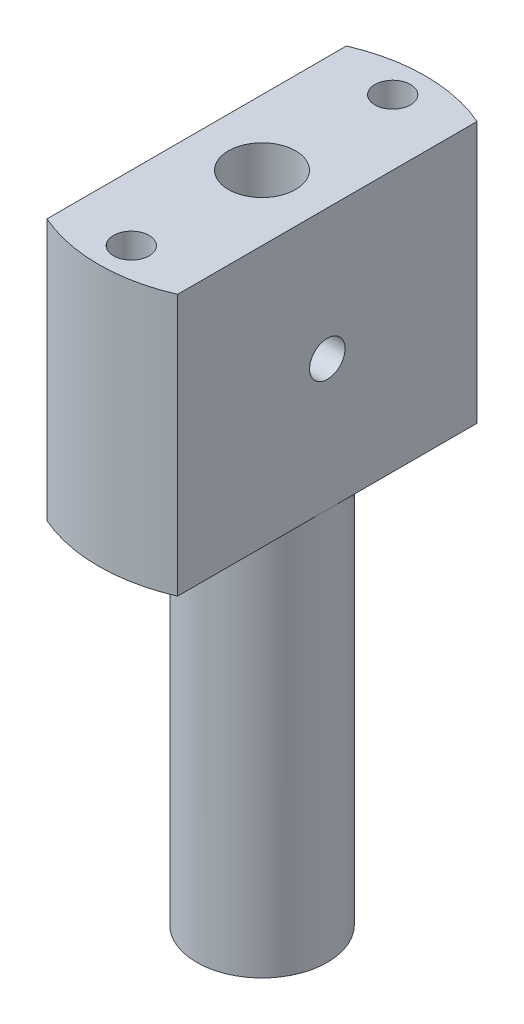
ISO-10303-21;
HEADER;
FILE_DESCRIPTION(('STEP AP214'),'2;1');
FILE_NAME('part.step','',(''),(''),'','','');
FILE_SCHEMA(('AUTOMOTIVE_DESIGN { 1 0 10303 214 1 1 1 1 }'));
ENDSEC;
DATA;
#1=APPLICATION_CONTEXT('core data for automotive mechanical design processes');
#2=APPLICATION_PROTOCOL_DEFINITION('international standard','automotive_design',2000,#1);
#3=PRODUCT_CONTEXT('',#1,'mechanical');
#4=PRODUCT('Part','Part','',(#3));
#5=PRODUCT_RELATED_PRODUCT_CATEGORY('part','',(#4));
#6=PRODUCT_DEFINITION_FORMATION('','',#4);
#7=PRODUCT_DEFINITION_CONTEXT('part definition',#1,'design');
#8=PRODUCT_DEFINITION('design','',#6,#7);
#9=PRODUCT_DEFINITION_SHAPE('','',#8);
#10=(LENGTH_UNIT() NAMED_UNIT(*) SI_UNIT(.MILLI.,.METRE.));
#11=(NAMED_UNIT(*) PLANE_ANGLE_UNIT() SI_UNIT($,.RADIAN.));
#12=(NAMED_UNIT(*) SI_UNIT($,.STERADIAN.) SOLID_ANGLE_UNIT());
#13=UNCERTAINTY_MEASURE_WITH_UNIT(LENGTH_MEASURE(1.E-05),#10,'distance_accuracy_value','');
#14=(GEOMETRIC_REPRESENTATION_CONTEXT(3) GLOBAL_UNCERTAINTY_ASSIGNED_CONTEXT((#13)) GLOBAL_UNIT_ASSIGNED_CONTEXT((#10,
#11,#12)) REPRESENTATION_CONTEXT('',''));
#15=CARTESIAN_POINT('',(0.,0.,0.));
#16=DIRECTION('',(0.,0.,1.));
#17=DIRECTION('',(1.,0.,0.));
#18=AXIS2_PLACEMENT_3D('',#15,#16,#17);
#19=CARTESIAN_POINT('',(-12.7355087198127,63.5,-12.7355087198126));
#20=DIRECTION('',(0.,-1.,0.));
#21=DIRECTION('',(0.,0.,-1.));
#22=AXIS2_PLACEMENT_3D('',#19,#20,#21);
#23=CYLINDRICAL_SURFACE('',#22,15.875);
#24=DIRECTION('',(0.,-1.,0.));
#25=VECTOR('',#24,1.);
#26=CARTESIAN_POINT('',(-19.0855087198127,63.5,-27.2851865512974));
#27=LINE('',#26,#25);
#28=CARTESIAN_POINT('',(-19.0855087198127,63.5,-27.2851865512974));
#29=VERTEX_POINT('',#28);
#30=CARTESIAN_POINT('',(-19.0855087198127,38.1,-27.2851865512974));
#31=VERTEX_POINT('',#30);
#32=EDGE_CURVE('E118',#29,#31,#27,.T.);
#33=ORIENTED_EDGE('',*,*,#32,.F.);
#34=CARTESIAN_POINT('',(-12.7355087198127,63.5,-12.7355087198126));
#35=DIRECTION('',(0.,1.,0.));
#36=DIRECTION('',(0.,0.,1.));
#37=AXIS2_PLACEMENT_3D('',#34,#35,#36);
#38=CIRCLE('',#37,15.875);
#39=CARTESIAN_POINT('',(-6.38550871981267,63.5,-27.2851865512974));
#40=VERTEX_POINT('',#39);
#41=EDGE_CURVE('E110',#40,#29,#38,.T.);
#42=ORIENTED_EDGE('',*,*,#41,.F.);
#43=DIRECTION('',(0.,-1.,0.));
#44=VECTOR('',#43,1.);
#45=CARTESIAN_POINT('',(-6.38550871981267,63.5,-27.2851865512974));
#46=LINE('',#45,#44);
#47=CARTESIAN_POINT('',(-6.38550871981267,38.1,-27.2851865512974));
#48=VERTEX_POINT('',#47);
#49=EDGE_CURVE('E92',#40,#48,#46,.T.);
#50=ORIENTED_EDGE('',*,*,#49,.T.);
#51=CARTESIAN_POINT('',(-12.7355087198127,38.1,-12.7355087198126));
#52=DIRECTION('',(0.,1.,0.));
#53=DIRECTION('',(0.,0.,1.));
#54=AXIS2_PLACEMENT_3D('',#51,#52,#53);
#55=CIRCLE('',#54,15.875);
#56=EDGE_CURVE('E127',#48,#31,#55,.T.);
#57=ORIENTED_EDGE('',*,*,#56,.T.);
#58=EDGE_LOOP('',(#33,#42,#50,#57));
#59=FACE_BOUND('',#58,.T.);
#60=ADVANCED_FACE('F45',(#59),#23,.T.);
#61=DIRECTION('',(0.,-1.,0.));
#62=VECTOR('',#61,1.);
#63=CARTESIAN_POINT('',(-19.0855087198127,63.5,1.81416911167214));
#64=LINE('',#63,#62);
#65=CARTESIAN_POINT('',(-19.0855087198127,38.1,1.81416911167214));
#66=VERTEX_POINT('',#65);
#67=CARTESIAN_POINT('',(-19.0855087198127,63.5,1.81416911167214));
#68=VERTEX_POINT('',#67);
#69=EDGE_CURVE('E103',#66,#68,#64,.F.);
#70=ORIENTED_EDGE('',*,*,#69,.F.);
#71=CARTESIAN_POINT('',(-6.38550871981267,38.1,1.81416911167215));
#72=VERTEX_POINT('',#71);
#73=EDGE_CURVE('E132',#66,#72,#55,.T.);
#74=ORIENTED_EDGE('',*,*,#73,.T.);
#75=DIRECTION('',(0.,-1.,0.));
#76=VECTOR('',#75,1.);
#77=CARTESIAN_POINT('',(-6.38550871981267,63.5,1.81416911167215));
#78=LINE('',#77,#76);
#79=CARTESIAN_POINT('',(-6.38550871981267,63.5,1.81416911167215));
#80=VERTEX_POINT('',#79);
#81=EDGE_CURVE('E61',#72,#80,#78,.F.);
#82=ORIENTED_EDGE('',*,*,#81,.T.);
#83=EDGE_CURVE('E112',#68,#80,#38,.T.);
#84=ORIENTED_EDGE('',*,*,#83,.F.);
#85=EDGE_LOOP('',(#70,#74,#82,#84));
#86=FACE_BOUND('',#85,.T.);
#87=ADVANCED_FACE('F157',(#86),#23,.T.);
#88=CARTESIAN_POINT('',(-12.7355087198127,63.5,-12.7355087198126));
#89=DIRECTION('',(0.,1.,0.));
#90=DIRECTION('',(0.,0.,1.));
#91=AXIS2_PLACEMENT_3D('',#88,#89,#90);
#92=PLANE('',#91);
#93=CARTESIAN_POINT('',(-12.7355087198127,63.5,-25.4355087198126));
#94=DIRECTION('',(0.,1.,0.));
#95=DIRECTION('',(0.,0.,1.));
#96=AXIS2_PLACEMENT_3D('',#93,#94,#95);
#97=CIRCLE('',#96,1.72719999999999);
#98=CARTESIAN_POINT('',(-12.7355087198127,63.5,-23.7083087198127));
#99=VERTEX_POINT('',#98);
#100=EDGE_CURVE('E145',#99,#99,#97,.T.);
#101=ORIENTED_EDGE('',*,*,#100,.F.);
#102=EDGE_LOOP('',(#101));
#103=FACE_BOUND('',#102,.T.);
#104=CARTESIAN_POINT('',(-12.7355087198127,63.5,-0.0355087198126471));
#105=DIRECTION('',(0.,1.,0.));
#106=DIRECTION('',(0.,0.,1.));
#107=AXIS2_PLACEMENT_3D('',#104,#105,#106);
#108=CIRCLE('',#107,1.72719999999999);
#109=CARTESIAN_POINT('',(-12.7355087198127,63.5,1.69169128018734));
#110=VERTEX_POINT('',#109);
#111=EDGE_CURVE('E144',#110,#110,#108,.T.);
#112=ORIENTED_EDGE('',*,*,#111,.F.);
#113=EDGE_LOOP('',(#112));
#114=FACE_BOUND('',#113,.T.);
#115=CARTESIAN_POINT('',(-12.7355087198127,63.5,-12.7355087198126));
#116=DIRECTION('',(0.,1.,0.));
#117=DIRECTION('',(0.,0.,1.));
#118=AXIS2_PLACEMENT_3D('',#115,#116,#117);
#119=CIRCLE('',#118,3.26389999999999);
#120=CARTESIAN_POINT('',(-12.7355087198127,63.5,-9.47160871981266));
#121=VERTEX_POINT('',#120);
#122=EDGE_CURVE('E196',#121,#121,#119,.T.);
#123=ORIENTED_EDGE('',*,*,#122,.F.);
#124=EDGE_LOOP('',(#123));
#125=FACE_BOUND('',#124,.T.);
#126=ORIENTED_EDGE('',*,*,#41,.T.);
#127=DIRECTION('',(0.,0.,1.));
#128=VECTOR('',#127,1.);
#129=CARTESIAN_POINT('',(-19.0855087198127,63.5,-29.282498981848));
#130=LINE('',#129,#128);
#131=EDGE_CURVE('E114',#29,#68,#130,.T.);
#132=ORIENTED_EDGE('',*,*,#131,.T.);
#133=ORIENTED_EDGE('',*,*,#83,.T.);
#134=DIRECTION('',(0.,0.,1.));
#135=VECTOR('',#134,1.);
#136=CARTESIAN_POINT('',(-6.38550871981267,63.5,-29.282498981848));
#137=LINE('',#136,#135);
#138=EDGE_CURVE('E95',#40,#80,#137,.T.);
#139=ORIENTED_EDGE('',*,*,#138,.F.);
#140=EDGE_LOOP('',(#126,#132,#133,#139));
#141=FACE_BOUND('',#140,.T.);
#142=ADVANCED_FACE('F108',(#103,#114,#125,#141),#92,.T.);
#143=CARTESIAN_POINT('',(-12.7355087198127,38.1,-12.7355087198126));
#144=DIRECTION('',(0.,1.,0.));
#145=DIRECTION('',(0.,0.,1.));
#146=AXIS2_PLACEMENT_3D('',#143,#144,#145);
#147=PLANE('',#146);
#148=CARTESIAN_POINT('',(-12.7355087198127,38.1,-25.4355087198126));
#149=DIRECTION('',(0.,1.,0.));
#150=DIRECTION('',(0.,0.,1.));
#151=AXIS2_PLACEMENT_3D('',#148,#149,#150);
#152=CIRCLE('',#151,1.72719999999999);
#153=CARTESIAN_POINT('',(-12.7355087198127,38.1,-23.7083087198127));
#154=VERTEX_POINT('',#153);
#155=EDGE_CURVE('E141',#154,#154,#152,.T.);
#156=ORIENTED_EDGE('',*,*,#155,.T.);
#157=EDGE_LOOP('',(#156));
#158=FACE_BOUND('',#157,.T.);
#159=DIRECTION('',(0.,0.,1.));
#160=VECTOR('',#159,1.);
#161=CARTESIAN_POINT('',(-19.0855087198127,38.1,-12.7355087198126));
#162=LINE('',#161,#160);
#163=CARTESIAN_POINT('',(-19.0855087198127,38.1,-12.7355087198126));
#164=VERTEX_POINT('',#163);
#165=EDGE_CURVE('E11',#31,#164,#162,.T.);
#166=ORIENTED_EDGE('',*,*,#165,.F.);
#167=ORIENTED_EDGE('',*,*,#56,.F.);
#168=DIRECTION('',(0.,0.,1.));
#169=VECTOR('',#168,1.);
#170=CARTESIAN_POINT('',(-6.38550871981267,38.1,-12.7355087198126));
#171=LINE('',#170,#169);
#172=CARTESIAN_POINT('',(-6.38550871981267,38.1,-12.7355087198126));
#173=VERTEX_POINT('',#172);
#174=EDGE_CURVE('E97',#48,#173,#171,.T.);
#175=ORIENTED_EDGE('',*,*,#174,.T.);
#176=CARTESIAN_POINT('',(-12.7355087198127,38.1,-12.7355087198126));
#177=DIRECTION('',(0.,1.,0.));
#178=DIRECTION('',(0.,0.,1.));
#179=AXIS2_PLACEMENT_3D('',#176,#177,#178);
#180=CIRCLE('',#179,6.35);
#181=EDGE_CURVE('E136',#173,#164,#180,.T.);
#182=ORIENTED_EDGE('',*,*,#181,.T.);
#183=EDGE_LOOP('',(#166,#167,#175,#182));
#184=FACE_BOUND('',#183,.T.);
#185=ADVANCED_FACE('F162',(#158,#184),#147,.F.);
#186=CARTESIAN_POINT('',(-12.7355087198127,38.1,-0.0355087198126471));
#187=DIRECTION('',(0.,1.,0.));
#188=DIRECTION('',(0.,0.,1.));
#189=AXIS2_PLACEMENT_3D('',#186,#187,#188);
#190=CIRCLE('',#189,1.72719999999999);
#191=CARTESIAN_POINT('',(-12.7355087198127,38.1,1.69169128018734));
#192=VERTEX_POINT('',#191);
#193=EDGE_CURVE('E199',#192,#192,#190,.T.);
#194=ORIENTED_EDGE('',*,*,#193,.T.);
#195=EDGE_LOOP('',(#194));
#196=FACE_BOUND('',#195,.T.);
#197=EDGE_CURVE('E49',#164,#66,#162,.T.);
#198=ORIENTED_EDGE('',*,*,#197,.F.);
#199=EDGE_CURVE('E125',#164,#173,#180,.T.);
#200=ORIENTED_EDGE('',*,*,#199,.T.);
#201=EDGE_CURVE('E139',#173,#72,#171,.T.);
#202=ORIENTED_EDGE('',*,*,#201,.T.);
#203=ORIENTED_EDGE('',*,*,#73,.F.);
#204=EDGE_LOOP('',(#198,#200,#202,#203));
#205=FACE_BOUND('',#204,.T.);
#206=ADVANCED_FACE('F160',(#196,#205),#147,.F.);
#207=CARTESIAN_POINT('',(-12.7355087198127,38.1,-12.7355087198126));
#208=DIRECTION('',(0.,-1.,0.));
#209=DIRECTION('',(0.,0.,-1.));
#210=AXIS2_PLACEMENT_3D('',#207,#208,#209);
#211=CYLINDRICAL_SURFACE('',#210,6.35);
#212=CARTESIAN_POINT('',(-12.7355087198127,0.,-12.7355087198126));
#213=DIRECTION('',(0.,1.,0.));
#214=DIRECTION('',(0.,0.,1.));
#215=AXIS2_PLACEMENT_3D('',#212,#213,#214);
#216=CIRCLE('',#215,6.35);
#217=CARTESIAN_POINT('',(-12.7355087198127,0.,-6.38550871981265));
#218=VERTEX_POINT('',#217);
#219=EDGE_CURVE('E120',#218,#218,#216,.T.);
#220=ORIENTED_EDGE('',*,*,#219,.T.);
#221=EDGE_LOOP('',(#220));
#222=FACE_BOUND('',#221,.T.);
#223=ORIENTED_EDGE('',*,*,#199,.F.);
#224=ORIENTED_EDGE('',*,*,#181,.F.);
#225=EDGE_LOOP('',(#223,#224));
#226=FACE_BOUND('',#225,.T.);
#227=ADVANCED_FACE('F47',(#222,#226),#211,.T.);
#228=CARTESIAN_POINT('',(-12.7355087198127,0.,-12.7355087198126));
#229=DIRECTION('',(0.,1.,0.));
#230=DIRECTION('',(0.,0.,1.));
#231=AXIS2_PLACEMENT_3D('',#228,#229,#230);
#232=PLANE('',#231);
#233=ORIENTED_EDGE('',*,*,#219,.F.);
#234=EDGE_LOOP('',(#233));
#235=FACE_BOUND('',#234,.T.);
#236=ADVANCED_FACE('F169',(#235),#232,.F.);
#237=CARTESIAN_POINT('',(-12.7355087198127,12.7,-12.7355087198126));
#238=DIRECTION('',(0.,1.,0.));
#239=DIRECTION('',(0.,0.,1.));
#240=AXIS2_PLACEMENT_3D('',#237,#238,#239);
#241=CONICAL_SURFACE('',#240,3.26389999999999,1.02974425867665);
#242=CARTESIAN_POINT('',(-12.7355087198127,10.7388510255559,-12.7355087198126));
#243=VERTEX_POINT('',#242);
#244=VERTEX_LOOP('',#243);
#245=FACE_BOUND('',#244,.T.);
#246=CARTESIAN_POINT('',(-12.7355087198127,12.7,-12.7355087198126));
#247=DIRECTION('',(0.,1.,0.));
#248=DIRECTION('',(0.,0.,1.));
#249=AXIS2_PLACEMENT_3D('',#246,#247,#248);
#250=CIRCLE('',#249,3.26389999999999);
#251=CARTESIAN_POINT('',(-12.7355087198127,12.7,-9.47160871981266));
#252=VERTEX_POINT('',#251);
#253=EDGE_CURVE('E130',#252,#252,#250,.T.);
#254=ORIENTED_EDGE('',*,*,#253,.T.);
#255=EDGE_LOOP('',(#254));
#256=FACE_BOUND('',#255,.T.);
#257=ADVANCED_FACE('F180',(#245,#256),#241,.F.);
#258=CARTESIAN_POINT('',(-12.7355087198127,63.5,-12.7355087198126));
#259=DIRECTION('',(0.,1.,0.));
#260=DIRECTION('',(0.,0.,1.));
#261=AXIS2_PLACEMENT_3D('',#258,#259,#260);
#262=CYLINDRICAL_SURFACE('',#261,3.26389999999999);
#263=CARTESIAN_POINT('',(-9.96606412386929,50.8,-14.4627087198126));
#264=CARTESIAN_POINT('',(-9.96605514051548,50.8891559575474,-14.4627019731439));
#265=CARTESIAN_POINT('',(-9.96169183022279,50.9784051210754,-14.4557583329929));
#266=CARTESIAN_POINT('',(-9.94489840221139,51.1540954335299,-14.4283695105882));
#267=CARTESIAN_POINT('',(-9.93245332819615,51.2405310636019,-14.4078992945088));
#268=CARTESIAN_POINT('',(-9.90135685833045,51.4077113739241,-14.3546325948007));
#269=CARTESIAN_POINT('',(-9.88274171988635,51.4884860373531,-14.3219079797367));
#270=CARTESIAN_POINT('',(-9.84146024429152,51.6433738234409,-14.2452820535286));
#271=CARTESIAN_POINT('',(-9.81879330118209,51.7174859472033,-14.2013790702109));
#272=CARTESIAN_POINT('',(-9.76939381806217,51.8645427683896,-14.098861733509));
#273=CARTESIAN_POINT('',(-9.74247922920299,51.9367373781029,-14.039258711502));
#274=CARTESIAN_POINT('',(-9.68908071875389,52.0706997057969,-13.909081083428));
#275=CARTESIAN_POINT('',(-9.66259704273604,52.1324616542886,-13.8385004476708));
#276=CARTESIAN_POINT('',(-9.61058598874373,52.2485225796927,-13.6816773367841));
#277=CARTESIAN_POINT('',(-9.58529312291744,52.3018677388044,-13.5946437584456));
#278=CARTESIAN_POINT('',(-9.54093604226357,52.3928123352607,-13.411246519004));
#279=CARTESIAN_POINT('',(-9.5218674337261,52.4304228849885,-13.3148895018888));
#280=CARTESIAN_POINT('',(-9.49342988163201,52.4857545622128,-13.1235534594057));
#281=CARTESIAN_POINT('',(-9.48341947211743,52.5048001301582,-13.0290550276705));
#282=CARTESIAN_POINT('',(-9.47180559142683,52.526854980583,-12.8377181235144));
#283=CARTESIAN_POINT('',(-9.47019631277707,52.5298753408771,-12.7408813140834));
#284=CARTESIAN_POINT('',(-9.47529241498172,52.5202309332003,-12.5577094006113));
#285=CARTESIAN_POINT('',(-9.48120535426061,52.5090612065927,-12.4712678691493));
#286=CARTESIAN_POINT('',(-9.499442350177,52.474074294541,-12.3016997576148));
#287=CARTESIAN_POINT('',(-9.51176689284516,52.4502561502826,-12.2185734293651));
#288=CARTESIAN_POINT('',(-9.54190736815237,52.3905770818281,-12.0566678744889));
#289=CARTESIAN_POINT('',(-9.5597888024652,52.3545720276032,-11.977954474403));
#290=CARTESIAN_POINT('',(-9.59948365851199,52.2717840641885,-11.8275155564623));
#291=CARTESIAN_POINT('',(-9.62129841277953,52.2249975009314,-11.7557924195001));
#292=CARTESIAN_POINT('',(-9.66950481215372,52.1164942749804,-11.6135165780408));
#293=CARTESIAN_POINT('',(-9.69613639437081,52.0537389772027,-11.5438369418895));
#294=CARTESIAN_POINT('',(-9.74963472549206,51.9178216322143,-11.4154918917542));
#295=CARTESIAN_POINT('',(-9.77650166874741,51.8446500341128,-11.3568367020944));
#296=CARTESIAN_POINT('',(-9.82974027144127,51.6831283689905,-11.2477192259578));
#297=CARTESIAN_POINT('',(-9.85591361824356,51.5940426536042,-11.1982388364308));
#298=CARTESIAN_POINT('',(-9.90172971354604,51.4071533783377,-11.1153224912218));
#299=CARTESIAN_POINT('',(-9.92137980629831,51.3093597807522,-11.0818684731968));
#300=CARTESIAN_POINT('',(-9.94958650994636,51.1160780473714,-11.0348079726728));
#301=CARTESIAN_POINT('',(-9.95891333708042,51.0210457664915,-11.0198122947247));
#302=CARTESIAN_POINT('',(-9.96755601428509,50.8293940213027,-11.0058953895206));
#303=CARTESIAN_POINT('',(-9.966881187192,50.7327761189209,-11.0069591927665));
#304=CARTESIAN_POINT('',(-9.95641640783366,50.5541074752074,-11.0238568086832));
#305=CARTESIAN_POINT('',(-9.94781875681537,50.4717912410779,-11.0377591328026));
#306=CARTESIAN_POINT('',(-9.92432769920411,50.3108576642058,-11.0769483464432));
#307=CARTESIAN_POINT('',(-9.90943188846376,50.2322417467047,-11.1022395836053));
#308=CARTESIAN_POINT('',(-9.87426530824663,50.0768941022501,-11.1646300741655));
#309=CARTESIAN_POINT('',(-9.85378407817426,50.0004035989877,-11.2022065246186));
#310=CARTESIAN_POINT('',(-9.80989768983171,49.854358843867,-11.2876995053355));
#311=CARTESIAN_POINT('',(-9.78649104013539,49.7848081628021,-11.3356213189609));
#312=CARTESIAN_POINT('',(-9.73533446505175,49.6440929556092,-11.4485101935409));
#313=CARTESIAN_POINT('',(-9.70744554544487,49.5741464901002,-11.5149395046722));
#314=CARTESIAN_POINT('',(-9.65331873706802,49.4459503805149,-11.6589102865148));
#315=CARTESIAN_POINT('',(-9.62708163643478,49.3877062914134,-11.7364570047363));
#316=CARTESIAN_POINT('',(-9.57791703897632,49.2824983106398,-11.9044805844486));
#317=CARTESIAN_POINT('',(-9.55516103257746,49.2360703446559,-11.9953469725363));
#318=CARTESIAN_POINT('',(-9.51689336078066,49.1596458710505,-12.1851493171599));
#319=CARTESIAN_POINT('',(-9.50137462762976,49.1296333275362,-12.2840772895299));
#320=CARTESIAN_POINT('',(-9.48058445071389,49.0897470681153,-12.4767343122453));
#321=CARTESIAN_POINT('',(-9.47445737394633,49.078187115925,-12.5700218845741));
#322=CARTESIAN_POINT('',(-9.47033965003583,49.0703987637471,-12.7573991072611));
#323=CARTESIAN_POINT('',(-9.47234538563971,49.0741635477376,-12.8514883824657));
#324=CARTESIAN_POINT('',(-9.4837805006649,49.0958918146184,-13.0299093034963));
#325=CARTESIAN_POINT('',(-9.49260980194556,49.112708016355,-13.1144238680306));
#326=CARTESIAN_POINT('',(-9.51614252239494,49.158391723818,-13.2792540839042));
#327=CARTESIAN_POINT('',(-9.53084669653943,49.1872607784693,-13.3595691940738));
#328=CARTESIAN_POINT('',(-9.56553794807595,49.257323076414,-13.5172360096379));
#329=CARTESIAN_POINT('',(-9.58570655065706,49.2989478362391,-13.5943547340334));
#330=CARTESIAN_POINT('',(-9.6293402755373,49.392809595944,-13.7407991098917));
#331=CARTESIAN_POINT('',(-9.65280683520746,49.4450512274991,-13.8101213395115));
#332=CARTESIAN_POINT('',(-9.70380846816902,49.5652282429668,-13.9470098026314));
#333=CARTESIAN_POINT('',(-9.73150811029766,49.6342539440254,-14.013559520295));
#334=CARTESIAN_POINT('',(-9.78592537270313,49.7826591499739,-14.1345852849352));
#335=CARTESIAN_POINT('',(-9.81264191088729,49.8620496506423,-14.1890483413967));
#336=CARTESIAN_POINT('',(-9.86333013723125,50.034050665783,-14.2869032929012));
#337=CARTESIAN_POINT('',(-9.88709259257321,50.1271286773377,-14.3295896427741));
#338=CARTESIAN_POINT('',(-9.92648517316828,50.3207728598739,-14.3980439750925));
#339=CARTESIAN_POINT('',(-9.94214198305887,50.4213131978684,-14.4238675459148));
#340=CARTESIAN_POINT('',(-9.95684366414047,50.5692732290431,-14.447853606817));
#341=CARTESIAN_POINT('',(-9.960284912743,50.6151638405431,-14.4534129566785));
#342=CARTESIAN_POINT('',(-9.96489752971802,50.7073612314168,-14.4608423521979));
#343=CARTESIAN_POINT('',(-9.96606879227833,50.7536680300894,-14.4627122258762));
#344=CARTESIAN_POINT('',(-9.96606412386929,50.8,-14.4627087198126));
#345=B_SPLINE_CURVE_WITH_KNOTS('',3,(#263,#264,#265,#266,#267,#268,#269,#270,#271,#272,#273,
#274,#275,#276,#277,#278,#279,#280,#281,#282,#283,#284,#285,#286,#287,#288,#289,#290,#291,#292,
#293,#294,#295,#296,#297,#298,#299,#300,#301,#302,#303,#304,#305,#306,#307,#308,#309,#310,#311,
#312,#313,#314,#315,#316,#317,#318,#319,#320,#321,#322,#323,#324,#325,#326,#327,#328,#329,#330,
#331,#332,#333,#334,#335,#336,#337,#338,#339,#340,#341,#342,#343,#344),.UNSPECIFIED.,.T.,.F.,(4,
2,2,2,2,2,2,2,2,2,2,2,2,2,2,2,2,2,2,2,2,2,2,2,2,2,2,2,2,2,2,2,2,2,2,2,2,2,2,2,4),(0.,
0.267272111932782,0.535040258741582,0.801262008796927,1.06752360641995,1.35855681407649,
1.64975044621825,1.96358808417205,2.27720370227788,2.56631505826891,2.85522653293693,
3.11607527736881,3.37694379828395,3.64101206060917,3.90516995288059,4.19639666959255,
4.48789215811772,4.80188821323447,5.11552954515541,5.40374338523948,5.69168858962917,
5.94232705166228,6.19306127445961,6.45500102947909,6.71707487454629,7.01700457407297,
7.31707631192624,7.62899110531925,7.94060064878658,8.22165340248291,8.50258116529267,
8.76127598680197,9.02000406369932,9.28868872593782,9.55749085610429,9.85561623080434,
10.1540604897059,10.4677120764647,10.7803244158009,10.9192121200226,11.0581062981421),.UNSPECIFIED.);
#346=CARTESIAN_POINT('',(-9.96606412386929,50.8,-14.4627087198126));
#347=VERTEX_POINT('',#346);
#348=EDGE_CURVE('E115',#347,#347,#345,.T.);
#349=ORIENTED_EDGE('',*,*,#348,.T.);
#350=EDGE_LOOP('',(#349));
#351=FACE_BOUND('',#350,.T.);
#352=ORIENTED_EDGE('',*,*,#253,.F.);
#353=EDGE_LOOP('',(#352));
#354=FACE_BOUND('',#353,.T.);
#355=ORIENTED_EDGE('',*,*,#122,.T.);
#356=EDGE_LOOP('',(#355));
#357=FACE_BOUND('',#356,.T.);
#358=ADVANCED_FACE('F185',(#351,#354,#357),#262,.F.);
#359=CARTESIAN_POINT('',(-12.7355087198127,63.5,-0.0355087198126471));
#360=DIRECTION('',(0.,1.,0.));
#361=DIRECTION('',(0.,0.,1.));
#362=AXIS2_PLACEMENT_3D('',#359,#360,#361);
#363=CYLINDRICAL_SURFACE('',#362,1.72719999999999);
#364=ORIENTED_EDGE('',*,*,#111,.T.);
#365=EDGE_LOOP('',(#364));
#366=FACE_BOUND('',#365,.T.);
#367=ORIENTED_EDGE('',*,*,#193,.F.);
#368=EDGE_LOOP('',(#367));
#369=FACE_BOUND('',#368,.T.);
#370=ADVANCED_FACE('F240',(#366,#369),#363,.F.);
#371=CARTESIAN_POINT('',(-12.7355087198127,63.5,-25.4355087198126));
#372=DIRECTION('',(0.,1.,0.));
#373=DIRECTION('',(0.,0.,1.));
#374=AXIS2_PLACEMENT_3D('',#371,#372,#373);
#375=CYLINDRICAL_SURFACE('',#374,1.72719999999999);
#376=ORIENTED_EDGE('',*,*,#100,.T.);
#377=EDGE_LOOP('',(#376));
#378=FACE_BOUND('',#377,.T.);
#379=ORIENTED_EDGE('',*,*,#155,.F.);
#380=EDGE_LOOP('',(#379));
#381=FACE_BOUND('',#380,.T.);
#382=ADVANCED_FACE('F255',(#378,#381),#375,.F.);
#383=CARTESIAN_POINT('',(-6.38550871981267,0.,-29.282498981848));
#384=DIRECTION('',(-1.,0.,0.));
#385=DIRECTION('',(0.,0.,1.));
#386=AXIS2_PLACEMENT_3D('',#383,#384,#385);
#387=PLANE('',#386);
#388=CARTESIAN_POINT('',(-6.38550871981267,50.8,-12.7355087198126));
#389=DIRECTION('',(1.,0.,0.));
#390=DIRECTION('',(0.,0.,-1.));
#391=AXIS2_PLACEMENT_3D('',#388,#389,#390);
#392=CIRCLE('',#391,1.72719999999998);
#393=CARTESIAN_POINT('',(-6.38550871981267,50.8,-14.4627087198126));
#394=VERTEX_POINT('',#393);
#395=EDGE_CURVE('E216',#394,#394,#392,.T.);
#396=ORIENTED_EDGE('',*,*,#395,.F.);
#397=EDGE_LOOP('',(#396));
#398=FACE_BOUND('',#397,.T.);
#399=ORIENTED_EDGE('',*,*,#138,.T.);
#400=ORIENTED_EDGE('',*,*,#81,.F.);
#401=ORIENTED_EDGE('',*,*,#201,.F.);
#402=ORIENTED_EDGE('',*,*,#174,.F.);
#403=ORIENTED_EDGE('',*,*,#49,.F.);
#404=EDGE_LOOP('',(#399,#400,#401,#402,#403));
#405=FACE_BOUND('',#404,.T.);
#406=ADVANCED_FACE('F94',(#398,#405),#387,.F.);
#407=CARTESIAN_POINT('',(-19.0855087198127,0.,-29.282498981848));
#408=DIRECTION('',(-1.,0.,0.));
#409=DIRECTION('',(0.,0.,1.));
#410=AXIS2_PLACEMENT_3D('',#407,#408,#409);
#411=PLANE('',#410);
#412=ORIENTED_EDGE('',*,*,#32,.T.);
#413=ORIENTED_EDGE('',*,*,#165,.T.);
#414=ORIENTED_EDGE('',*,*,#197,.T.);
#415=ORIENTED_EDGE('',*,*,#69,.T.);
#416=ORIENTED_EDGE('',*,*,#131,.F.);
#417=EDGE_LOOP('',(#412,#413,#414,#415,#416));
#418=FACE_BOUND('',#417,.T.);
#419=ADVANCED_FACE('F154',(#418),#411,.T.);
#420=CARTESIAN_POINT('',(-6.38550871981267,50.8,-12.7355087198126));
#421=DIRECTION('',(1.,0.,0.));
#422=DIRECTION('',(0.,0.,-1.));
#423=AXIS2_PLACEMENT_3D('',#420,#421,#422);
#424=CYLINDRICAL_SURFACE('',#423,1.72719999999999);
#425=ORIENTED_EDGE('',*,*,#348,.F.);
#426=EDGE_LOOP('',(#425));
#427=FACE_BOUND('',#426,.T.);
#428=ORIENTED_EDGE('',*,*,#395,.T.);
#429=EDGE_LOOP('',(#428));
#430=FACE_BOUND('',#429,.T.);
#431=ADVANCED_FACE('F229',(#427,#430),#424,.F.);
#432=CLOSED_SHELL('',(#60,#87,#142,#185,#206,#227,#236,#257,#358,#370,#382,#406,#419,#431));
#433=MANIFOLD_SOLID_BREP('B2',#432);
#434=ADVANCED_BREP_SHAPE_REPRESENTATION('',(#18,#433),#14);
#435=SHAPE_DEFINITION_REPRESENTATION(#9,#434);
ENDSEC;
END-ISO-10303-21;
